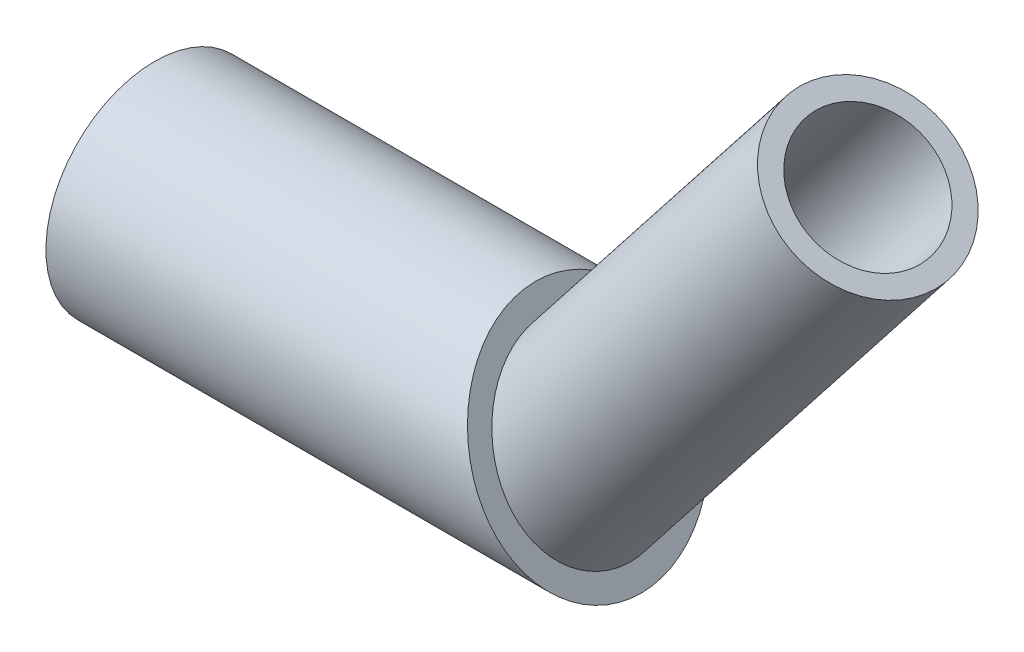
ISO-10303-21;
HEADER;
FILE_DESCRIPTION(('STEP AP214'),'2;1');
FILE_NAME('part.step','',(''),(''),'','','');
FILE_SCHEMA(('AUTOMOTIVE_DESIGN { 1 0 10303 214 1 1 1 1 }'));
ENDSEC;
DATA;
#1=APPLICATION_CONTEXT('core data for automotive mechanical design processes');
#2=APPLICATION_PROTOCOL_DEFINITION('international standard','automotive_design',2000,#1);
#3=PRODUCT_CONTEXT('',#1,'mechanical');
#4=PRODUCT('Part','Part','',(#3));
#5=PRODUCT_RELATED_PRODUCT_CATEGORY('part','',(#4));
#6=PRODUCT_DEFINITION_FORMATION('','',#4);
#7=PRODUCT_DEFINITION_CONTEXT('part definition',#1,'design');
#8=PRODUCT_DEFINITION('design','',#6,#7);
#9=PRODUCT_DEFINITION_SHAPE('','',#8);
#10=(LENGTH_UNIT() NAMED_UNIT(*) SI_UNIT(.MILLI.,.METRE.));
#11=(NAMED_UNIT(*) PLANE_ANGLE_UNIT() SI_UNIT($,.RADIAN.));
#12=(NAMED_UNIT(*) SI_UNIT($,.STERADIAN.) SOLID_ANGLE_UNIT());
#13=UNCERTAINTY_MEASURE_WITH_UNIT(LENGTH_MEASURE(1.E-05),#10,'distance_accuracy_value','');
#14=(GEOMETRIC_REPRESENTATION_CONTEXT(3) GLOBAL_UNCERTAINTY_ASSIGNED_CONTEXT((#13)) GLOBAL_UNIT_ASSIGNED_CONTEXT((#10,
#11,#12)) REPRESENTATION_CONTEXT('',''));
#15=CARTESIAN_POINT('',(0.,0.,0.));
#16=DIRECTION('',(0.,0.,1.));
#17=DIRECTION('',(1.,0.,0.));
#18=AXIS2_PLACEMENT_3D('',#15,#16,#17);
#19=CARTESIAN_POINT('',(67.2648034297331,0.,0.));
#20=DIRECTION('',(-1.,0.,0.));
#21=DIRECTION('',(0.,0.,1.));
#22=AXIS2_PLACEMENT_3D('',#19,#20,#21);
#23=CYLINDRICAL_SURFACE('',#22,12.85);
#24=CARTESIAN_POINT('',(0.,0.,0.));
#25=DIRECTION('',(1.,0.,0.));
#26=DIRECTION('',(0.,0.,-1.));
#27=AXIS2_PLACEMENT_3D('',#24,#25,#26);
#28=CIRCLE('',#27,12.85);
#29=CARTESIAN_POINT('',(0.,0.,-12.85));
#30=VERTEX_POINT('',#29);
#31=EDGE_CURVE('E51',#30,#30,#28,.T.);
#32=ORIENTED_EDGE('',*,*,#31,.F.);
#33=EDGE_LOOP('',(#32));
#34=FACE_BOUND('',#33,.T.);
#35=CARTESIAN_POINT('',(67.2648034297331,0.,0.));
#36=DIRECTION('',(0.899283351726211,0.43736649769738,0.));
#37=DIRECTION('',(-0.43736649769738,0.899283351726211,0.));
#38=AXIS2_PLACEMENT_3D('',#35,#36,#37);
#39=ELLIPSE('',#38,14.2891558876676,12.85);
#40=CARTESIAN_POINT('',(61.015205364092,12.85,0.));
#41=VERTEX_POINT('',#40);
#42=EDGE_CURVE('E47',#41,#41,#39,.T.);
#43=ORIENTED_EDGE('',*,*,#42,.T.);
#44=EDGE_LOOP('',(#43));
#45=FACE_BOUND('',#44,.T.);
#46=ADVANCED_FACE('F43',(#34,#45),#23,.F.);
#47=CARTESIAN_POINT('',(67.2648034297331,0.,0.));
#48=DIRECTION('',(-1.,0.,0.));
#49=DIRECTION('',(0.,0.,1.));
#50=AXIS2_PLACEMENT_3D('',#47,#48,#49);
#51=CYLINDRICAL_SURFACE('',#50,16.85);
#52=CARTESIAN_POINT('',(0.,0.,0.));
#53=DIRECTION('',(1.,0.,0.));
#54=DIRECTION('',(0.,0.,-1.));
#55=AXIS2_PLACEMENT_3D('',#52,#53,#54);
#56=CIRCLE('',#55,16.85);
#57=CARTESIAN_POINT('',(0.,0.,-16.85));
#58=VERTEX_POINT('',#57);
#59=EDGE_CURVE('E55',#58,#58,#56,.T.);
#60=ORIENTED_EDGE('',*,*,#59,.T.);
#61=EDGE_LOOP('',(#60));
#62=FACE_BOUND('',#61,.T.);
#63=CARTESIAN_POINT('',(67.2648034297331,0.,0.));
#64=DIRECTION('',(0.899283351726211,0.43736649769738,0.));
#65=DIRECTION('',(-0.43736649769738,0.899283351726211,0.));
#66=AXIS2_PLACEMENT_3D('',#63,#64,#65);
#67=ELLIPSE('',#66,18.7371421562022,16.85);
#68=CARTESIAN_POINT('',(59.069805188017,16.85,0.));
#69=VERTEX_POINT('',#68);
#70=EDGE_CURVE('E11',#69,#69,#67,.T.);
#71=ORIENTED_EDGE('',*,*,#70,.F.);
#72=EDGE_LOOP('',(#71));
#73=FACE_BOUND('',#72,.T.);
#74=ADVANCED_FACE('F70',(#62,#73),#51,.T.);
#75=CARTESIAN_POINT('',(0.,0.,0.));
#76=DIRECTION('',(1.,0.,0.));
#77=DIRECTION('',(0.,0.,-1.));
#78=AXIS2_PLACEMENT_3D('',#75,#76,#77);
#79=PLANE('',#78);
#80=ORIENTED_EDGE('',*,*,#31,.T.);
#81=EDGE_LOOP('',(#80));
#82=FACE_BOUND('',#81,.T.);
#83=ORIENTED_EDGE('',*,*,#59,.F.);
#84=EDGE_LOOP('',(#83));
#85=FACE_BOUND('',#84,.T.);
#86=ADVANCED_FACE('F66',(#82,#85),#79,.F.);
#87=CARTESIAN_POINT('',(67.2648034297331,0.,0.));
#88=DIRECTION('',(0.899283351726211,0.43736649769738,0.));
#89=DIRECTION('',(-0.43736649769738,0.899283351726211,0.));
#90=AXIS2_PLACEMENT_3D('',#87,#88,#89);
#91=PLANE('',#90);
#92=ORIENTED_EDGE('',*,*,#42,.F.);
#93=EDGE_LOOP('',(#92));
#94=FACE_BOUND('',#93,.T.);
#95=ORIENTED_EDGE('',*,*,#70,.T.);
#96=EDGE_LOOP('',(#95));
#97=FACE_BOUND('',#96,.T.);
#98=ADVANCED_FACE('F45',(#94,#97),#91,.T.);
#99=CLOSED_SHELL('',(#46,#74,#86,#98));
#100=MANIFOLD_SOLID_BREP('B2',#99);
#101=CARTESIAN_POINT('',(110.61665125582,55.2329466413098,0.));
#102=DIRECTION('',(-0.617421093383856,-0.786632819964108,0.));
#103=DIRECTION('',(0.786632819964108,-0.617421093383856,0.));
#104=AXIS2_PLACEMENT_3D('',#101,#102,#103);
#105=CYLINDRICAL_SURFACE('',#104,10.25);
#106=CARTESIAN_POINT('',(67.2648034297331,0.,0.));
#107=DIRECTION('',(0.899283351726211,0.43736649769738,0.));
#108=DIRECTION('',(0.43736649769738,-0.899283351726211,0.));
#109=AXIS2_PLACEMENT_3D('',#106,#107,#108);
#110=ELLIPSE('',#109,11.39796481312,10.25);
#111=CARTESIAN_POINT('',(72.2498913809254,-10.25,0.));
#112=VERTEX_POINT('',#111);
#113=EDGE_CURVE('E119',#112,#112,#110,.T.);
#114=ORIENTED_EDGE('',*,*,#113,.F.);
#115=EDGE_LOOP('',(#114));
#116=FACE_BOUND('',#115,.T.);
#117=CARTESIAN_POINT('',(110.61665125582,55.2329466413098,0.));
#118=DIRECTION('',(0.617421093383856,0.786632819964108,0.));
#119=DIRECTION('',(-0.786632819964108,0.617421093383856,0.));
#120=AXIS2_PLACEMENT_3D('',#117,#118,#119);
#121=CIRCLE('',#120,10.25);
#122=CARTESIAN_POINT('',(102.553664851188,61.5615128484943,0.));
#123=VERTEX_POINT('',#122);
#124=EDGE_CURVE('E128',#123,#123,#121,.T.);
#125=ORIENTED_EDGE('',*,*,#124,.T.);
#126=EDGE_LOOP('',(#125));
#127=FACE_BOUND('',#126,.T.);
#128=ADVANCED_FACE('F113',(#116,#127),#105,.F.);
#129=CARTESIAN_POINT('',(110.61665125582,55.2329466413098,0.));
#130=DIRECTION('',(0.617421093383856,0.786632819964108,0.));
#131=DIRECTION('',(-0.786632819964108,0.617421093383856,0.));
#132=AXIS2_PLACEMENT_3D('',#129,#130,#131);
#133=PLANE('',#132);
#134=ORIENTED_EDGE('',*,*,#124,.F.);
#135=EDGE_LOOP('',(#134));
#136=FACE_BOUND('',#135,.T.);
#137=CARTESIAN_POINT('',(110.61665125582,55.2329466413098,0.));
#138=DIRECTION('',(0.617421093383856,0.786632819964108,0.));
#139=DIRECTION('',(-0.786632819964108,0.617421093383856,0.));
#140=AXIS2_PLACEMENT_3D('',#137,#138,#139);
#141=CIRCLE('',#140,13.45);
#142=CARTESIAN_POINT('',(100.036439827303,63.5372603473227,0.));
#143=VERTEX_POINT('',#142);
#144=EDGE_CURVE('E123',#143,#143,#141,.T.);
#145=ORIENTED_EDGE('',*,*,#144,.T.);
#146=EDGE_LOOP('',(#145));
#147=FACE_BOUND('',#146,.T.);
#148=ADVANCED_FACE('F134',(#136,#147),#133,.T.);
#149=CARTESIAN_POINT('',(110.61665125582,55.2329466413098,0.));
#150=DIRECTION('',(-0.617421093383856,-0.786632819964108,0.));
#151=DIRECTION('',(0.786632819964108,-0.617421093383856,0.));
#152=AXIS2_PLACEMENT_3D('',#149,#150,#151);
#153=CYLINDRICAL_SURFACE('',#152,13.45);
#154=CARTESIAN_POINT('',(67.2648034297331,0.,0.));
#155=DIRECTION('',(0.899283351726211,0.43736649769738,0.));
#156=DIRECTION('',(0.43736649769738,-0.899283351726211,0.));
#157=AXIS2_PLACEMENT_3D('',#154,#155,#156);
#158=ELLIPSE('',#157,14.9563538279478,13.45);
#159=CARTESIAN_POINT('',(73.8062115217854,-13.45,0.));
#160=VERTEX_POINT('',#159);
#161=EDGE_CURVE('E42',#160,#160,#158,.T.);
#162=ORIENTED_EDGE('',*,*,#161,.T.);
#163=EDGE_LOOP('',(#162));
#164=FACE_BOUND('',#163,.T.);
#165=ORIENTED_EDGE('',*,*,#144,.F.);
#166=EDGE_LOOP('',(#165));
#167=FACE_BOUND('',#166,.T.);
#168=ADVANCED_FACE('F137',(#164,#167),#153,.T.);
#169=CARTESIAN_POINT('',(67.2648034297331,0.,0.));
#170=DIRECTION('',(0.899283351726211,0.43736649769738,0.));
#171=DIRECTION('',(-0.43736649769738,0.899283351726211,0.));
#172=AXIS2_PLACEMENT_3D('',#169,#170,#171);
#173=PLANE('',#172);
#174=ORIENTED_EDGE('',*,*,#113,.T.);
#175=EDGE_LOOP('',(#174));
#176=FACE_BOUND('',#175,.T.);
#177=ORIENTED_EDGE('',*,*,#161,.F.);
#178=EDGE_LOOP('',(#177));
#179=FACE_BOUND('',#178,.T.);
#180=ADVANCED_FACE('F142',(#176,#179),#173,.F.);
#181=CLOSED_SHELL('',(#128,#148,#168,#180));
#182=MANIFOLD_SOLID_BREP('B6',#181);
#183=ADVANCED_BREP_SHAPE_REPRESENTATION('',(#18,#100,#182),#14);
#184=SHAPE_DEFINITION_REPRESENTATION(#9,#183);
ENDSEC;
END-ISO-10303-21;
